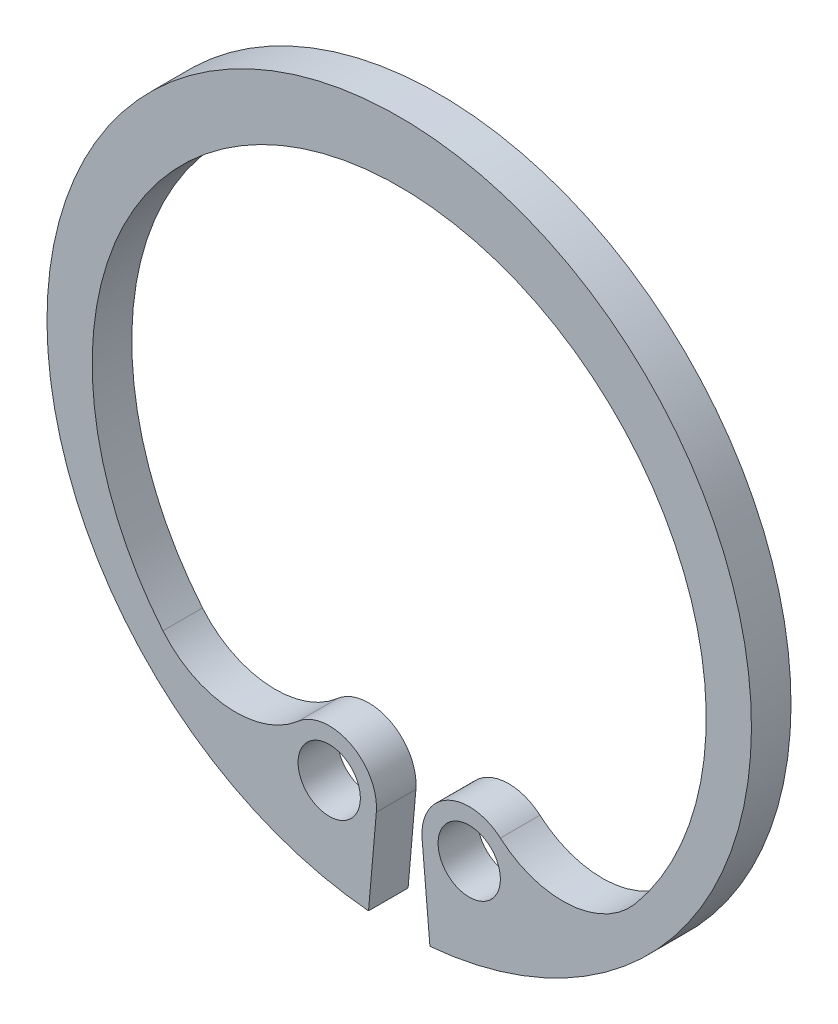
ISO-10303-21;
HEADER;
FILE_DESCRIPTION(('STEP AP214'),'2;1');
FILE_NAME('part.step','',(''),(''),'','','');
FILE_SCHEMA(('AUTOMOTIVE_DESIGN { 1 0 10303 214 1 1 1 1 }'));
ENDSEC;
DATA;
#1=APPLICATION_CONTEXT('core data for automotive mechanical design processes');
#2=APPLICATION_PROTOCOL_DEFINITION('international standard','automotive_design',2000,#1);
#3=PRODUCT_CONTEXT('',#1,'mechanical');
#4=PRODUCT('Part','Part','',(#3));
#5=PRODUCT_RELATED_PRODUCT_CATEGORY('part','',(#4));
#6=PRODUCT_DEFINITION_FORMATION('','',#4);
#7=PRODUCT_DEFINITION_CONTEXT('part definition',#1,'design');
#8=PRODUCT_DEFINITION('design','',#6,#7);
#9=PRODUCT_DEFINITION_SHAPE('','',#8);
#10=(LENGTH_UNIT() NAMED_UNIT(*) SI_UNIT(.MILLI.,.METRE.));
#11=(NAMED_UNIT(*) PLANE_ANGLE_UNIT() SI_UNIT($,.RADIAN.));
#12=(NAMED_UNIT(*) SI_UNIT($,.STERADIAN.) SOLID_ANGLE_UNIT());
#13=UNCERTAINTY_MEASURE_WITH_UNIT(LENGTH_MEASURE(1.E-05),#10,'distance_accuracy_value','');
#14=(GEOMETRIC_REPRESENTATION_CONTEXT(3) GLOBAL_UNCERTAINTY_ASSIGNED_CONTEXT((#13)) GLOBAL_UNIT_ASSIGNED_CONTEXT((#10,
#11,#12)) REPRESENTATION_CONTEXT('',''));
#15=CARTESIAN_POINT('',(0.,0.,0.));
#16=DIRECTION('',(0.,0.,1.));
#17=DIRECTION('',(1.,0.,0.));
#18=AXIS2_PLACEMENT_3D('',#15,#16,#17);
#19=CARTESIAN_POINT('',(0.,0.,-1.));
#20=DIRECTION('',(0.,0.,1.));
#21=DIRECTION('',(1.,0.,0.));
#22=AXIS2_PLACEMENT_3D('',#19,#20,#21);
#23=CYLINDRICAL_SURFACE('',#22,8.9);
#24=CARTESIAN_POINT('',(0.,0.,0.));
#25=DIRECTION('',(0.,0.,1.));
#26=DIRECTION('',(1.,0.,0.));
#27=AXIS2_PLACEMENT_3D('',#24,#25,#26);
#28=CIRCLE('',#27,8.9);
#29=CARTESIAN_POINT('',(0.775686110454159,-8.86613281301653,0.));
#30=VERTEX_POINT('',#29);
#31=CARTESIAN_POINT('',(-0.77568611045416,-8.86613281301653,0.));
#32=VERTEX_POINT('',#31);
#33=EDGE_CURVE('E94',#30,#32,#28,.T.);
#34=ORIENTED_EDGE('',*,*,#33,.F.);
#35=DIRECTION('',(0.,0.,1.));
#36=VECTOR('',#35,1.);
#37=CARTESIAN_POINT('',(0.775686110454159,-8.86613281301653,-1.));
#38=LINE('',#37,#36);
#39=CARTESIAN_POINT('',(0.775686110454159,-8.86613281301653,-1.));
#40=VERTEX_POINT('',#39);
#41=EDGE_CURVE('E11',#40,#30,#38,.T.);
#42=ORIENTED_EDGE('',*,*,#41,.F.);
#43=CARTESIAN_POINT('',(0.,0.,-1.));
#44=DIRECTION('',(0.,0.,1.));
#45=DIRECTION('',(1.,0.,0.));
#46=AXIS2_PLACEMENT_3D('',#43,#44,#45);
#47=CIRCLE('',#46,8.9);
#48=CARTESIAN_POINT('',(-0.77568611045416,-8.86613281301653,-1.));
#49=VERTEX_POINT('',#48);
#50=EDGE_CURVE('E96',#40,#49,#47,.T.);
#51=ORIENTED_EDGE('',*,*,#50,.T.);
#52=DIRECTION('',(0.,0.,1.));
#53=VECTOR('',#52,1.);
#54=CARTESIAN_POINT('',(-0.77568611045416,-8.86613281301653,-1.));
#55=LINE('',#54,#53);
#56=EDGE_CURVE('E33',#49,#32,#55,.T.);
#57=ORIENTED_EDGE('',*,*,#56,.T.);
#58=EDGE_LOOP('',(#34,#42,#51,#57));
#59=FACE_BOUND('',#58,.T.);
#60=ADVANCED_FACE('F30',(#59),#23,.T.);
#61=CARTESIAN_POINT('',(0.775686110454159,-8.86613281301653,-1.));
#62=DIRECTION('',(-0.996194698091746,-0.0871557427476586,0.));
#63=DIRECTION('',(0.0871557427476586,-0.996194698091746,0.));
#64=AXIS2_PLACEMENT_3D('',#61,#62,#63);
#65=PLANE('',#64);
#66=DIRECTION('',(0.0871557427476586,-0.996194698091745,0.));
#67=VECTOR('',#66,1.);
#68=CARTESIAN_POINT('',(0.775686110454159,-8.86613281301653,0.));
#69=LINE('',#68,#67);
#70=CARTESIAN_POINT('',(0.57832875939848,-6.6103279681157,0.));
#71=VERTEX_POINT('',#70);
#72=EDGE_CURVE('E112',#71,#30,#69,.T.);
#73=ORIENTED_EDGE('',*,*,#72,.F.);
#74=DIRECTION('',(0.,0.,1.));
#75=VECTOR('',#74,1.);
#76=CARTESIAN_POINT('',(0.57832875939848,-6.6103279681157,-1.));
#77=LINE('',#76,#75);
#78=CARTESIAN_POINT('',(0.57832875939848,-6.6103279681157,-1.));
#79=VERTEX_POINT('',#78);
#80=EDGE_CURVE('E38',#79,#71,#77,.T.);
#81=ORIENTED_EDGE('',*,*,#80,.F.);
#82=DIRECTION('',(0.0871557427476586,-0.996194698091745,0.));
#83=VECTOR('',#82,1.);
#84=CARTESIAN_POINT('',(0.775686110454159,-8.86613281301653,-1.));
#85=LINE('',#84,#83);
#86=EDGE_CURVE('E101',#79,#40,#85,.T.);
#87=ORIENTED_EDGE('',*,*,#86,.T.);
#88=ORIENTED_EDGE('',*,*,#41,.T.);
#89=EDGE_LOOP('',(#73,#81,#87,#88));
#90=FACE_BOUND('',#89,.T.);
#91=ADVANCED_FACE('F178',(#90),#65,.T.);
#92=CARTESIAN_POINT('',(1.76893085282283,-6.50616378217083,-1.));
#93=DIRECTION('',(0.,0.,1.));
#94=DIRECTION('',(1.,0.,0.));
#95=AXIS2_PLACEMENT_3D('',#92,#93,#94);
#96=CYLINDRICAL_SURFACE('',#95,1.19515);
#97=CARTESIAN_POINT('',(1.76893085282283,-6.50616378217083,0.));
#98=DIRECTION('',(0.,0.,1.));
#99=DIRECTION('',(1.,0.,0.));
#100=AXIS2_PLACEMENT_3D('',#97,#98,#99);
#101=CIRCLE('',#100,1.19515);
#102=CARTESIAN_POINT('',(2.55617945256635,-5.60692901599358,0.));
#103=VERTEX_POINT('',#102);
#104=EDGE_CURVE('E130',#103,#71,#101,.T.);
#105=ORIENTED_EDGE('',*,*,#104,.F.);
#106=DIRECTION('',(0.,0.,1.));
#107=VECTOR('',#106,1.);
#108=CARTESIAN_POINT('',(2.55617945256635,-5.60692901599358,-1.));
#109=LINE('',#108,#107);
#110=CARTESIAN_POINT('',(2.55617945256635,-5.60692901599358,-1.));
#111=VERTEX_POINT('',#110);
#112=EDGE_CURVE('E152',#111,#103,#109,.T.);
#113=ORIENTED_EDGE('',*,*,#112,.F.);
#114=CARTESIAN_POINT('',(1.76893085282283,-6.50616378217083,-1.));
#115=DIRECTION('',(0.,0.,1.));
#116=DIRECTION('',(1.,0.,0.));
#117=AXIS2_PLACEMENT_3D('',#114,#115,#116);
#118=CIRCLE('',#117,1.19515);
#119=EDGE_CURVE('E148',#111,#79,#118,.T.);
#120=ORIENTED_EDGE('',*,*,#119,.T.);
#121=ORIENTED_EDGE('',*,*,#80,.T.);
#122=EDGE_LOOP('',(#105,#113,#120,#121));
#123=FACE_BOUND('',#122,.T.);
#124=ADVANCED_FACE('F177',(#123),#96,.T.);
#125=CARTESIAN_POINT('',(4.1306766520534,-3.80845948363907,-1.));
#126=DIRECTION('',(0.,0.,1.));
#127=DIRECTION('',(1.,0.,0.));
#128=AXIS2_PLACEMENT_3D('',#125,#126,#127);
#129=CYLINDRICAL_SURFACE('',#128,2.3903);
#130=CARTESIAN_POINT('',(4.1306766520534,-3.80845948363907,0.));
#131=DIRECTION('',(0.,0.,-1.));
#132=DIRECTION('',(1.,0.,0.));
#133=AXIS2_PLACEMENT_3D('',#130,#131,#132);
#134=CIRCLE('',#133,2.3903);
#135=CARTESIAN_POINT('',(5.97029269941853,-5.3346792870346,0.));
#136=VERTEX_POINT('',#135);
#137=EDGE_CURVE('E127',#136,#103,#134,.T.);
#138=ORIENTED_EDGE('',*,*,#137,.F.);
#139=DIRECTION('',(0.,0.,1.));
#140=VECTOR('',#139,1.);
#141=CARTESIAN_POINT('',(5.97029269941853,-5.3346792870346,-1.));
#142=LINE('',#141,#140);
#143=CARTESIAN_POINT('',(5.97029269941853,-5.3346792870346,-1.));
#144=VERTEX_POINT('',#143);
#145=EDGE_CURVE('E154',#144,#136,#142,.T.);
#146=ORIENTED_EDGE('',*,*,#145,.F.);
#147=CARTESIAN_POINT('',(4.1306766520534,-3.80845948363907,-1.));
#148=DIRECTION('',(0.,0.,-1.));
#149=DIRECTION('',(1.,0.,0.));
#150=AXIS2_PLACEMENT_3D('',#147,#148,#149);
#151=CIRCLE('',#150,2.3903);
#152=EDGE_CURVE('E145',#144,#111,#151,.T.);
#153=ORIENTED_EDGE('',*,*,#152,.T.);
#154=ORIENTED_EDGE('',*,*,#112,.T.);
#155=EDGE_LOOP('',(#138,#146,#153,#154));
#156=FACE_BOUND('',#155,.T.);
#157=ADVANCED_FACE('F173',(#156),#129,.F.);
#158=CARTESIAN_POINT('',(0.,-0.381483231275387,-1.));
#159=DIRECTION('',(0.,0.,1.));
#160=DIRECTION('',(1.,0.,0.));
#161=AXIS2_PLACEMENT_3D('',#158,#159,#160);
#162=CYLINDRICAL_SURFACE('',#161,7.75748323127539);
#163=CARTESIAN_POINT('',(0.,-0.381483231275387,0.));
#164=DIRECTION('',(0.,0.,-1.));
#165=DIRECTION('',(1.,0.,0.));
#166=AXIS2_PLACEMENT_3D('',#163,#164,#165);
#167=CIRCLE('',#166,7.75748323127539);
#168=CARTESIAN_POINT('',(-5.97029269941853,-5.3346792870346,0.));
#169=VERTEX_POINT('',#168);
#170=EDGE_CURVE('E124',#169,#136,#167,.T.);
#171=ORIENTED_EDGE('',*,*,#170,.F.);
#172=DIRECTION('',(0.,0.,1.));
#173=VECTOR('',#172,1.);
#174=CARTESIAN_POINT('',(-5.97029269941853,-5.3346792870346,-1.));
#175=LINE('',#174,#173);
#176=CARTESIAN_POINT('',(-5.97029269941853,-5.3346792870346,-1.));
#177=VERTEX_POINT('',#176);
#178=EDGE_CURVE('E156',#177,#169,#175,.T.);
#179=ORIENTED_EDGE('',*,*,#178,.F.);
#180=CARTESIAN_POINT('',(0.,-0.381483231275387,-1.));
#181=DIRECTION('',(0.,0.,-1.));
#182=DIRECTION('',(1.,0.,0.));
#183=AXIS2_PLACEMENT_3D('',#180,#181,#182);
#184=CIRCLE('',#183,7.75748323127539);
#185=EDGE_CURVE('E142',#177,#144,#184,.T.);
#186=ORIENTED_EDGE('',*,*,#185,.T.);
#187=ORIENTED_EDGE('',*,*,#145,.T.);
#188=EDGE_LOOP('',(#171,#179,#186,#187));
#189=FACE_BOUND('',#188,.T.);
#190=ADVANCED_FACE('F169',(#189),#162,.F.);
#191=CARTESIAN_POINT('',(-4.1306766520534,-3.80845948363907,-1.));
#192=DIRECTION('',(0.,0.,1.));
#193=DIRECTION('',(1.,0.,0.));
#194=AXIS2_PLACEMENT_3D('',#191,#192,#193);
#195=CYLINDRICAL_SURFACE('',#194,2.3903);
#196=CARTESIAN_POINT('',(-4.1306766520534,-3.80845948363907,0.));
#197=DIRECTION('',(0.,0.,-1.));
#198=DIRECTION('',(1.,0.,0.));
#199=AXIS2_PLACEMENT_3D('',#196,#197,#198);
#200=CIRCLE('',#199,2.3903);
#201=CARTESIAN_POINT('',(-2.55617945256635,-5.60692901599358,0.));
#202=VERTEX_POINT('',#201);
#203=EDGE_CURVE('E121',#202,#169,#200,.T.);
#204=ORIENTED_EDGE('',*,*,#203,.F.);
#205=DIRECTION('',(0.,0.,1.));
#206=VECTOR('',#205,1.);
#207=CARTESIAN_POINT('',(-2.55617945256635,-5.60692901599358,-1.));
#208=LINE('',#207,#206);
#209=CARTESIAN_POINT('',(-2.55617945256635,-5.60692901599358,-1.));
#210=VERTEX_POINT('',#209);
#211=EDGE_CURVE('E158',#210,#202,#208,.T.);
#212=ORIENTED_EDGE('',*,*,#211,.F.);
#213=CARTESIAN_POINT('',(-4.1306766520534,-3.80845948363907,-1.));
#214=DIRECTION('',(0.,0.,-1.));
#215=DIRECTION('',(1.,0.,0.));
#216=AXIS2_PLACEMENT_3D('',#213,#214,#215);
#217=CIRCLE('',#216,2.3903);
#218=EDGE_CURVE('E139',#210,#177,#217,.T.);
#219=ORIENTED_EDGE('',*,*,#218,.T.);
#220=ORIENTED_EDGE('',*,*,#178,.T.);
#221=EDGE_LOOP('',(#204,#212,#219,#220));
#222=FACE_BOUND('',#221,.T.);
#223=ADVANCED_FACE('F165',(#222),#195,.F.);
#224=CARTESIAN_POINT('',(-1.76893085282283,-6.50616378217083,-1.));
#225=DIRECTION('',(0.,0.,1.));
#226=DIRECTION('',(1.,0.,0.));
#227=AXIS2_PLACEMENT_3D('',#224,#225,#226);
#228=CYLINDRICAL_SURFACE('',#227,1.19515);
#229=CARTESIAN_POINT('',(-1.76893085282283,-6.50616378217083,0.));
#230=DIRECTION('',(0.,0.,1.));
#231=DIRECTION('',(1.,0.,0.));
#232=AXIS2_PLACEMENT_3D('',#229,#230,#231);
#233=CIRCLE('',#232,1.19515);
#234=CARTESIAN_POINT('',(-0.578328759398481,-6.6103279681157,0.));
#235=VERTEX_POINT('',#234);
#236=EDGE_CURVE('E108',#235,#202,#233,.T.);
#237=ORIENTED_EDGE('',*,*,#236,.F.);
#238=DIRECTION('',(0.,0.,1.));
#239=VECTOR('',#238,1.);
#240=CARTESIAN_POINT('',(-0.578328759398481,-6.6103279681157,-1.));
#241=LINE('',#240,#239);
#242=CARTESIAN_POINT('',(-0.578328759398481,-6.6103279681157,-1.));
#243=VERTEX_POINT('',#242);
#244=EDGE_CURVE('E100',#243,#235,#241,.T.);
#245=ORIENTED_EDGE('',*,*,#244,.F.);
#246=CARTESIAN_POINT('',(-1.76893085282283,-6.50616378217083,-1.));
#247=DIRECTION('',(0.,0.,1.));
#248=DIRECTION('',(1.,0.,0.));
#249=AXIS2_PLACEMENT_3D('',#246,#247,#248);
#250=CIRCLE('',#249,1.19515);
#251=EDGE_CURVE('E136',#243,#210,#250,.T.);
#252=ORIENTED_EDGE('',*,*,#251,.T.);
#253=ORIENTED_EDGE('',*,*,#211,.T.);
#254=EDGE_LOOP('',(#237,#245,#252,#253));
#255=FACE_BOUND('',#254,.T.);
#256=ADVANCED_FACE('F161',(#255),#228,.T.);
#257=CARTESIAN_POINT('',(-0.77568611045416,-8.86613281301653,-1.));
#258=DIRECTION('',(0.996194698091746,-0.0871557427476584,0.));
#259=DIRECTION('',(0.0871557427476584,0.996194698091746,0.));
#260=AXIS2_PLACEMENT_3D('',#257,#258,#259);
#261=PLANE('',#260);
#262=DIRECTION('',(0.0871557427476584,0.996194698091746,0.));
#263=VECTOR('',#262,1.);
#264=CARTESIAN_POINT('',(-0.77568611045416,-8.86613281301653,0.));
#265=LINE('',#264,#263);
#266=EDGE_CURVE('E103',#32,#235,#265,.T.);
#267=ORIENTED_EDGE('',*,*,#266,.F.);
#268=ORIENTED_EDGE('',*,*,#56,.F.);
#269=DIRECTION('',(0.0871557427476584,0.996194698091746,0.));
#270=VECTOR('',#269,1.);
#271=CARTESIAN_POINT('',(-0.77568611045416,-8.86613281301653,-1.));
#272=LINE('',#271,#270);
#273=EDGE_CURVE('E134',#49,#243,#272,.T.);
#274=ORIENTED_EDGE('',*,*,#273,.T.);
#275=ORIENTED_EDGE('',*,*,#244,.T.);
#276=EDGE_LOOP('',(#267,#268,#274,#275));
#277=FACE_BOUND('',#276,.T.);
#278=ADVANCED_FACE('F104',(#277),#261,.T.);
#279=CARTESIAN_POINT('',(0.,0.,-1.));
#280=DIRECTION('',(0.,0.,1.));
#281=DIRECTION('',(1.,0.,0.));
#282=AXIS2_PLACEMENT_3D('',#279,#280,#281);
#283=PLANE('',#282);
#284=CARTESIAN_POINT('',(-1.76893085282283,-6.50616378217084,-1.));
#285=DIRECTION('',(0.,0.,1.));
#286=DIRECTION('',(1.,0.,0.));
#287=AXIS2_PLACEMENT_3D('',#284,#285,#286);
#288=CIRCLE('',#287,0.7874);
#289=CARTESIAN_POINT('',(-0.981530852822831,-6.50616378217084,-1.));
#290=VERTEX_POINT('',#289);
#291=EDGE_CURVE('E254',#290,#290,#288,.T.);
#292=ORIENTED_EDGE('',*,*,#291,.T.);
#293=EDGE_LOOP('',(#292));
#294=FACE_BOUND('',#293,.T.);
#295=CARTESIAN_POINT('',(1.76893085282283,-6.50616378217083,-1.));
#296=DIRECTION('',(0.,0.,1.));
#297=DIRECTION('',(1.,0.,0.));
#298=AXIS2_PLACEMENT_3D('',#295,#296,#297);
#299=CIRCLE('',#298,0.7874);
#300=CARTESIAN_POINT('',(2.55633085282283,-6.50616378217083,-1.));
#301=VERTEX_POINT('',#300);
#302=EDGE_CURVE('E113',#301,#301,#299,.T.);
#303=ORIENTED_EDGE('',*,*,#302,.T.);
#304=EDGE_LOOP('',(#303));
#305=FACE_BOUND('',#304,.T.);
#306=ORIENTED_EDGE('',*,*,#50,.F.);
#307=ORIENTED_EDGE('',*,*,#86,.F.);
#308=ORIENTED_EDGE('',*,*,#119,.F.);
#309=ORIENTED_EDGE('',*,*,#152,.F.);
#310=ORIENTED_EDGE('',*,*,#185,.F.);
#311=ORIENTED_EDGE('',*,*,#218,.F.);
#312=ORIENTED_EDGE('',*,*,#251,.F.);
#313=ORIENTED_EDGE('',*,*,#273,.F.);
#314=EDGE_LOOP('',(#306,#307,#308,#309,#310,#311,#312,#313));
#315=FACE_BOUND('',#314,.T.);
#316=ADVANCED_FACE('F181',(#294,#305,#315),#283,.F.);
#317=CARTESIAN_POINT('',(0.,0.,0.));
#318=DIRECTION('',(0.,0.,1.));
#319=DIRECTION('',(1.,0.,0.));
#320=AXIS2_PLACEMENT_3D('',#317,#318,#319);
#321=PLANE('',#320);
#322=CARTESIAN_POINT('',(-1.76893085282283,-6.50616378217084,0.));
#323=DIRECTION('',(0.,0.,1.));
#324=DIRECTION('',(1.,0.,0.));
#325=AXIS2_PLACEMENT_3D('',#322,#323,#324);
#326=CIRCLE('',#325,0.7874);
#327=CARTESIAN_POINT('',(-0.981530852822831,-6.50616378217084,0.));
#328=VERTEX_POINT('',#327);
#329=EDGE_CURVE('E257',#328,#328,#326,.T.);
#330=ORIENTED_EDGE('',*,*,#329,.F.);
#331=EDGE_LOOP('',(#330));
#332=FACE_BOUND('',#331,.T.);
#333=CARTESIAN_POINT('',(1.76893085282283,-6.50616378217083,0.));
#334=DIRECTION('',(0.,0.,1.));
#335=DIRECTION('',(1.,0.,0.));
#336=AXIS2_PLACEMENT_3D('',#333,#334,#335);
#337=CIRCLE('',#336,0.7874);
#338=CARTESIAN_POINT('',(2.55633085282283,-6.50616378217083,0.));
#339=VERTEX_POINT('',#338);
#340=EDGE_CURVE('E116',#339,#339,#337,.T.);
#341=ORIENTED_EDGE('',*,*,#340,.F.);
#342=EDGE_LOOP('',(#341));
#343=FACE_BOUND('',#342,.T.);
#344=ORIENTED_EDGE('',*,*,#33,.T.);
#345=ORIENTED_EDGE('',*,*,#266,.T.);
#346=ORIENTED_EDGE('',*,*,#236,.T.);
#347=ORIENTED_EDGE('',*,*,#203,.T.);
#348=ORIENTED_EDGE('',*,*,#170,.T.);
#349=ORIENTED_EDGE('',*,*,#137,.T.);
#350=ORIENTED_EDGE('',*,*,#104,.T.);
#351=ORIENTED_EDGE('',*,*,#72,.T.);
#352=EDGE_LOOP('',(#344,#345,#346,#347,#348,#349,#350,#351));
#353=FACE_BOUND('',#352,.T.);
#354=ADVANCED_FACE('F110',(#332,#343,#353),#321,.T.);
#355=CARTESIAN_POINT('',(1.76893085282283,-6.50616378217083,-1.));
#356=DIRECTION('',(0.,0.,1.));
#357=DIRECTION('',(1.,0.,0.));
#358=AXIS2_PLACEMENT_3D('',#355,#356,#357);
#359=CYLINDRICAL_SURFACE('',#358,0.7874);
#360=ORIENTED_EDGE('',*,*,#302,.F.);
#361=EDGE_LOOP('',(#360));
#362=FACE_BOUND('',#361,.T.);
#363=ORIENTED_EDGE('',*,*,#340,.T.);
#364=EDGE_LOOP('',(#363));
#365=FACE_BOUND('',#364,.T.);
#366=ADVANCED_FACE('F189',(#362,#365),#359,.F.);
#367=CARTESIAN_POINT('',(-1.76893085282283,-6.50616378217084,-1.));
#368=DIRECTION('',(0.,0.,1.));
#369=DIRECTION('',(1.,0.,0.));
#370=AXIS2_PLACEMENT_3D('',#367,#368,#369);
#371=CYLINDRICAL_SURFACE('',#370,0.7874);
#372=ORIENTED_EDGE('',*,*,#291,.F.);
#373=EDGE_LOOP('',(#372));
#374=FACE_BOUND('',#373,.T.);
#375=ORIENTED_EDGE('',*,*,#329,.T.);
#376=EDGE_LOOP('',(#375));
#377=FACE_BOUND('',#376,.T.);
#378=ADVANCED_FACE('F238',(#374,#377),#371,.F.);
#379=CLOSED_SHELL('',(#60,#91,#124,#157,#190,#223,#256,#278,#316,#354,#366,#378));
#380=MANIFOLD_SOLID_BREP('B2',#379);
#381=ADVANCED_BREP_SHAPE_REPRESENTATION('',(#18,#380),#14);
#382=SHAPE_DEFINITION_REPRESENTATION(#9,#381);
ENDSEC;
END-ISO-10303-21;
